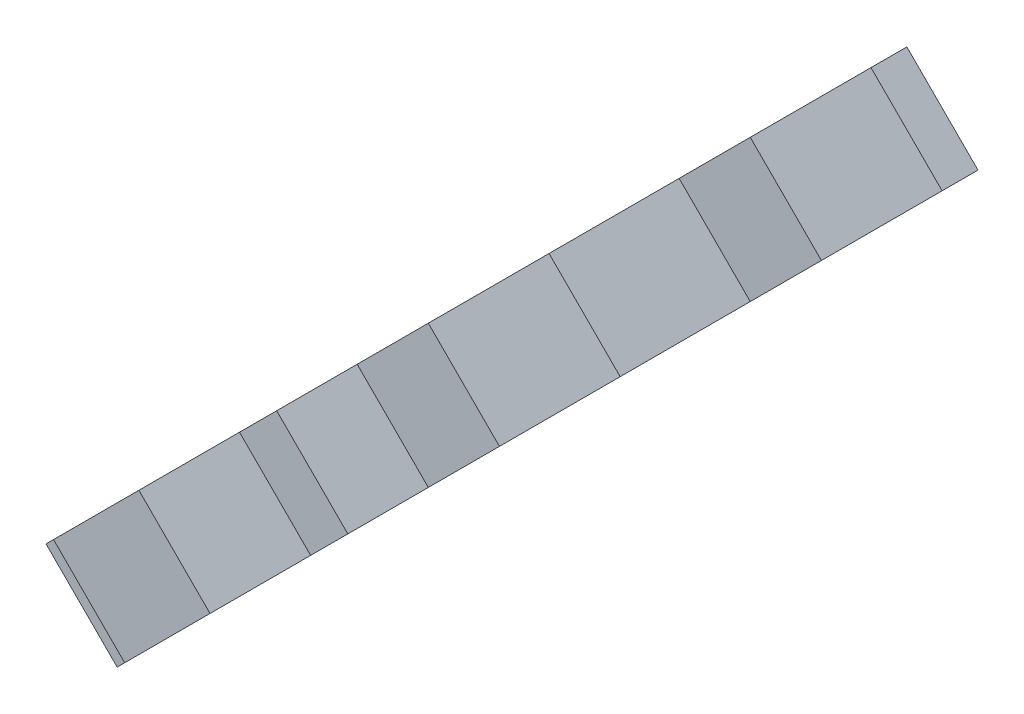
ISO-10303-21;
HEADER;
FILE_DESCRIPTION(('STEP AP214'),'2;1');
FILE_NAME('part.step','',(''),(''),'','','');
FILE_SCHEMA(('AUTOMOTIVE_DESIGN { 1 0 10303 214 1 1 1 1 }'));
ENDSEC;
DATA;
#1=APPLICATION_CONTEXT('core data for automotive mechanical design processes');
#2=APPLICATION_PROTOCOL_DEFINITION('international standard','automotive_design',2000,#1);
#3=PRODUCT_CONTEXT('',#1,'mechanical');
#4=PRODUCT('Part','Part','',(#3));
#5=PRODUCT_RELATED_PRODUCT_CATEGORY('part','',(#4));
#6=PRODUCT_DEFINITION_FORMATION('','',#4);
#7=PRODUCT_DEFINITION_CONTEXT('part definition',#1,'design');
#8=PRODUCT_DEFINITION('design','',#6,#7);
#9=PRODUCT_DEFINITION_SHAPE('','',#8);
#10=(LENGTH_UNIT() NAMED_UNIT(*) SI_UNIT(.MILLI.,.METRE.));
#11=(NAMED_UNIT(*) PLANE_ANGLE_UNIT() SI_UNIT($,.RADIAN.));
#12=(NAMED_UNIT(*) SI_UNIT($,.STERADIAN.) SOLID_ANGLE_UNIT());
#13=UNCERTAINTY_MEASURE_WITH_UNIT(LENGTH_MEASURE(1.E-05),#10,'distance_accuracy_value','');
#14=(GEOMETRIC_REPRESENTATION_CONTEXT(3) GLOBAL_UNCERTAINTY_ASSIGNED_CONTEXT((#13)) GLOBAL_UNIT_ASSIGNED_CONTEXT((#10,
#11,#12)) REPRESENTATION_CONTEXT('',''));
#15=CARTESIAN_POINT('',(0.,0.,0.));
#16=DIRECTION('',(0.,0.,1.));
#17=DIRECTION('',(1.,0.,0.));
#18=AXIS2_PLACEMENT_3D('',#15,#16,#17);
#19=CARTESIAN_POINT('',(-4.49012806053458,4.49012806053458,0.));
#20=DIRECTION('',(0.707106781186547,0.707106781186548,0.));
#21=DIRECTION('',(-0.707106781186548,0.707106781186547,0.));
#22=AXIS2_PLACEMENT_3D('',#19,#20,#21);
#23=PLANE('',#22);
#24=DIRECTION('',(0.,0.,1.));
#25=VECTOR('',#24,1.);
#26=CARTESIAN_POINT('',(-4.49012806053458,4.49012806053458,0.));
#27=LINE('',#26,#25);
#28=CARTESIAN_POINT('',(-4.49012806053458,4.49012806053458,-10.16));
#29=VERTEX_POINT('',#28);
#30=CARTESIAN_POINT('',(-4.49012806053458,4.49012806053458,0.));
#31=VERTEX_POINT('',#30);
#32=EDGE_CURVE('E318',#29,#31,#27,.T.);
#33=ORIENTED_EDGE('',*,*,#32,.F.);
#34=DIRECTION('',(-0.707106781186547,0.707106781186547,0.));
#35=VECTOR('',#34,1.);
#36=CARTESIAN_POINT('',(6.28617928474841,-6.28617928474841,-10.16));
#37=LINE('',#36,#35);
#38=CARTESIAN_POINT('',(0.,0.,-10.16));
#39=VERTEX_POINT('',#38);
#40=EDGE_CURVE('E221',#39,#29,#37,.T.);
#41=ORIENTED_EDGE('',*,*,#40,.F.);
#42=DIRECTION('',(0.,0.,1.));
#43=VECTOR('',#42,1.);
#44=CARTESIAN_POINT('',(0.,0.,0.));
#45=LINE('',#44,#43);
#46=CARTESIAN_POINT('',(0.,0.,0.));
#47=VERTEX_POINT('',#46);
#48=EDGE_CURVE('E312',#39,#47,#45,.T.);
#49=ORIENTED_EDGE('',*,*,#48,.T.);
#50=DIRECTION('',(0.707106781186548,-0.707106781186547,0.));
#51=VECTOR('',#50,1.);
#52=CARTESIAN_POINT('',(-4.49012806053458,4.49012806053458,0.));
#53=LINE('',#52,#51);
#54=EDGE_CURVE('E349',#31,#47,#53,.T.);
#55=ORIENTED_EDGE('',*,*,#54,.F.);
#56=EDGE_LOOP('',(#33,#41,#49,#55));
#57=FACE_BOUND('',#56,.T.);
#58=ADVANCED_FACE('F47',(#57),#23,.F.);
#59=CARTESIAN_POINT('',(14.5598719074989,23.5401280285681,0.));
#60=DIRECTION('',(-0.707106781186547,-0.707106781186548,0.));
#61=DIRECTION('',(0.707106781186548,-0.707106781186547,0.));
#62=AXIS2_PLACEMENT_3D('',#59,#60,#61);
#63=PLANE('',#62);
#64=DIRECTION('',(0.,0.,-1.));
#65=VECTOR('',#64,1.);
#66=CARTESIAN_POINT('',(19.0499999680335,19.0499999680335,0.));
#67=LINE('',#66,#65);
#68=CARTESIAN_POINT('',(19.0499999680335,19.0499999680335,-25.4));
#69=VERTEX_POINT('',#68);
#70=CARTESIAN_POINT('',(19.0499999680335,19.0499999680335,-33.02));
#71=VERTEX_POINT('',#70);
#72=EDGE_CURVE('E338',#69,#71,#67,.T.);
#73=ORIENTED_EDGE('',*,*,#72,.T.);
#74=DIRECTION('',(-0.707106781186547,0.707106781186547,0.));
#75=VECTOR('',#74,1.);
#76=CARTESIAN_POINT('',(25.3361792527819,12.7638206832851,-33.02));
#77=LINE('',#76,#75);
#78=CARTESIAN_POINT('',(14.5598719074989,23.5401280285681,-33.02));
#79=VERTEX_POINT('',#78);
#80=EDGE_CURVE('E189',#71,#79,#77,.T.);
#81=ORIENTED_EDGE('',*,*,#80,.T.);
#82=DIRECTION('',(0.,0.,-1.));
#83=VECTOR('',#82,1.);
#84=CARTESIAN_POINT('',(14.5598719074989,23.5401280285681,0.));
#85=LINE('',#84,#83);
#86=CARTESIAN_POINT('',(14.5598719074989,23.5401280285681,-25.4));
#87=VERTEX_POINT('',#86);
#88=EDGE_CURVE('E205',#87,#79,#85,.T.);
#89=ORIENTED_EDGE('',*,*,#88,.F.);
#90=DIRECTION('',(-0.707106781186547,0.707106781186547,0.));
#91=VECTOR('',#90,1.);
#92=CARTESIAN_POINT('',(25.3361792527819,12.7638206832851,-25.4));
#93=LINE('',#92,#91);
#94=EDGE_CURVE('E245',#69,#87,#93,.T.);
#95=ORIENTED_EDGE('',*,*,#94,.F.);
#96=EDGE_LOOP('',(#73,#81,#89,#95));
#97=FACE_BOUND('',#96,.T.);
#98=ADVANCED_FACE('F462',(#97),#63,.F.);
#99=CARTESIAN_POINT('',(-4.49012806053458,4.49012806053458,0.));
#100=DIRECTION('',(0.,0.,-1.));
#101=DIRECTION('',(-1.,0.,0.));
#102=AXIS2_PLACEMENT_3D('',#99,#100,#101);
#103=PLANE('',#102);
#104=DIRECTION('',(0.707106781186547,0.707106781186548,0.));
#105=VECTOR('',#104,1.);
#106=CARTESIAN_POINT('',(0.,0.,0.));
#107=LINE('',#106,#105);
#108=CARTESIAN_POINT('',(12.213148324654,12.213148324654,0.));
#109=VERTEX_POINT('',#108);
#110=CARTESIAN_POINT('',(14.5598719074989,14.5598719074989,0.));
#111=VERTEX_POINT('',#110);
#112=EDGE_CURVE('E334',#109,#111,#107,.T.);
#113=ORIENTED_EDGE('',*,*,#112,.T.);
#114=DIRECTION('',(-0.707106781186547,0.707106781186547,0.));
#115=VECTOR('',#114,1.);
#116=CARTESIAN_POINT('',(20.8460511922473,8.27369262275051,0.));
#117=LINE('',#116,#115);
#118=CARTESIAN_POINT('',(10.0697438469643,19.0499999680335,0.));
#119=VERTEX_POINT('',#118);
#120=EDGE_CURVE('E233',#111,#119,#117,.T.);
#121=ORIENTED_EDGE('',*,*,#120,.T.);
#122=DIRECTION('',(0.707106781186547,0.707106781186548,0.));
#123=VECTOR('',#122,1.);
#124=CARTESIAN_POINT('',(-4.49012806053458,4.49012806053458,0.));
#125=LINE('',#124,#123);
#126=CARTESIAN_POINT('',(7.72302026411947,16.7032763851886,0.));
#127=VERTEX_POINT('',#126);
#128=EDGE_CURVE('E317',#127,#119,#125,.T.);
#129=ORIENTED_EDGE('',*,*,#128,.F.);
#130=DIRECTION('',(-0.707106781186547,0.707106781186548,0.));
#131=VECTOR('',#130,1.);
#132=CARTESIAN_POINT('',(7.72302026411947,16.7032763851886,0.));
#133=LINE('',#132,#131);
#134=EDGE_CURVE('E281',#109,#127,#133,.T.);
#135=ORIENTED_EDGE('',*,*,#134,.F.);
#136=EDGE_LOOP('',(#113,#121,#129,#135));
#137=FACE_BOUND('',#136,.T.);
#138=ADVANCED_FACE('F433',(#137),#103,.F.);
#139=DIRECTION('',(0.707106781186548,-0.707106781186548,0.));
#140=VECTOR('',#139,1.);
#141=CARTESIAN_POINT('',(2.33486659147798,11.3151227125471,0.));
#142=LINE('',#141,#140);
#143=CARTESIAN_POINT('',(2.33486659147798,11.3151227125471,0.));
#144=VERTEX_POINT('',#143);
#145=CARTESIAN_POINT('',(6.82499465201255,6.82499465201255,0.));
#146=VERTEX_POINT('',#145);
#147=EDGE_CURVE('E275',#144,#146,#142,.T.);
#148=ORIENTED_EDGE('',*,*,#147,.F.);
#149=EDGE_CURVE('E319',#31,#144,#125,.T.);
#150=ORIENTED_EDGE('',*,*,#149,.F.);
#151=ORIENTED_EDGE('',*,*,#54,.T.);
#152=EDGE_CURVE('E335',#47,#146,#107,.T.);
#153=ORIENTED_EDGE('',*,*,#152,.T.);
#154=EDGE_LOOP('',(#148,#150,#151,#153));
#155=FACE_BOUND('',#154,.T.);
#156=ADVANCED_FACE('F417',(#155),#103,.F.);
#157=CARTESIAN_POINT('',(0.,0.,-26.67));
#158=VERTEX_POINT('',#157);
#159=CARTESIAN_POINT('',(0.,0.,-20.32));
#160=VERTEX_POINT('',#159);
#161=EDGE_CURVE('E330',#158,#160,#45,.T.);
#162=ORIENTED_EDGE('',*,*,#161,.T.);
#163=DIRECTION('',(-0.707106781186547,0.707106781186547,0.));
#164=VECTOR('',#163,1.);
#165=CARTESIAN_POINT('',(6.28617928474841,-6.28617928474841,-20.32));
#166=LINE('',#165,#164);
#167=CARTESIAN_POINT('',(-4.49012806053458,4.49012806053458,-20.32));
#168=VERTEX_POINT('',#167);
#169=EDGE_CURVE('E217',#160,#168,#166,.T.);
#170=ORIENTED_EDGE('',*,*,#169,.T.);
#171=CARTESIAN_POINT('',(-4.49012806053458,4.49012806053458,-26.67));
#172=VERTEX_POINT('',#171);
#173=EDGE_CURVE('E313',#172,#168,#27,.T.);
#174=ORIENTED_EDGE('',*,*,#173,.F.);
#175=DIRECTION('',(0.707106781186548,-0.707106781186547,0.));
#176=VECTOR('',#175,1.);
#177=CARTESIAN_POINT('',(-4.49012806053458,4.49012806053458,-26.67));
#178=LINE('',#177,#176);
#179=EDGE_CURVE('E329',#172,#158,#178,.T.);
#180=ORIENTED_EDGE('',*,*,#179,.T.);
#181=EDGE_LOOP('',(#162,#170,#174,#180));
#182=FACE_BOUND('',#181,.T.);
#183=ADVANCED_FACE('F49',(#182),#23,.F.);
#184=CARTESIAN_POINT('',(14.5598719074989,23.5401280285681,-5.08));
#185=VERTEX_POINT('',#184);
#186=CARTESIAN_POINT('',(14.5598719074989,23.5401280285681,-12.7));
#187=VERTEX_POINT('',#186);
#188=EDGE_CURVE('E325',#185,#187,#85,.T.);
#189=ORIENTED_EDGE('',*,*,#188,.F.);
#190=DIRECTION('',(-0.707106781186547,0.707106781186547,0.));
#191=VECTOR('',#190,1.);
#192=CARTESIAN_POINT('',(25.3361792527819,12.7638206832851,-5.08));
#193=LINE('',#192,#191);
#194=CARTESIAN_POINT('',(19.0499999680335,19.0499999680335,-5.08));
#195=VERTEX_POINT('',#194);
#196=EDGE_CURVE('E258',#195,#185,#193,.T.);
#197=ORIENTED_EDGE('',*,*,#196,.F.);
#198=CARTESIAN_POINT('',(19.0499999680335,19.0499999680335,-12.7));
#199=VERTEX_POINT('',#198);
#200=EDGE_CURVE('E342',#195,#199,#67,.T.);
#201=ORIENTED_EDGE('',*,*,#200,.T.);
#202=DIRECTION('',(-0.707106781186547,0.707106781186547,0.));
#203=VECTOR('',#202,1.);
#204=CARTESIAN_POINT('',(25.3361792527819,12.7638206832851,-12.7));
#205=LINE('',#204,#203);
#206=EDGE_CURVE('E241',#199,#187,#205,.T.);
#207=ORIENTED_EDGE('',*,*,#206,.T.);
#208=EDGE_LOOP('',(#189,#197,#201,#207));
#209=FACE_BOUND('',#208,.T.);
#210=ADVANCED_FACE('F446',(#209),#63,.F.);
#211=CARTESIAN_POINT('',(14.5598719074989,23.5401280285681,-43.815));
#212=DIRECTION('',(0.379642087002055,0.379642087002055,0.84364908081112));
#213=DIRECTION('',(0.,-0.911921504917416,0.410364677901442));
#214=AXIS2_PLACEMENT_3D('',#211,#212,#213);
#215=PLANE('',#214);
#216=DIRECTION('',(-0.59654998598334,-0.596549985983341,0.536894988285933));
#217=VECTOR('',#216,1.);
#218=CARTESIAN_POINT('',(14.5598719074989,23.5401280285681,-43.815));
#219=LINE('',#218,#217);
#220=CARTESIAN_POINT('',(10.0697438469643,19.0499999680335,-39.7738847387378));
#221=VERTEX_POINT('',#220);
#222=EDGE_CURVE('E326',#221,#172,#219,.T.);
#223=ORIENTED_EDGE('',*,*,#222,.F.);
#224=DIRECTION('',(0.707106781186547,-0.707106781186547,0.));
#225=VECTOR('',#224,1.);
#226=CARTESIAN_POINT('',(10.0697438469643,19.0499999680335,-39.7738847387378));
#227=LINE('',#226,#225);
#228=CARTESIAN_POINT('',(14.5598719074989,14.5598719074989,-39.7738847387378));
#229=VERTEX_POINT('',#228);
#230=EDGE_CURVE('E195',#221,#229,#227,.T.);
#231=ORIENTED_EDGE('',*,*,#230,.T.);
#232=DIRECTION('',(-0.59654998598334,-0.596549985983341,0.536894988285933));
#233=VECTOR('',#232,1.);
#234=CARTESIAN_POINT('',(19.0499999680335,19.0499999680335,-43.815));
#235=LINE('',#234,#233);
#236=EDGE_CURVE('E343',#229,#158,#235,.T.);
#237=ORIENTED_EDGE('',*,*,#236,.T.);
#238=ORIENTED_EDGE('',*,*,#179,.F.);
#239=EDGE_LOOP('',(#223,#231,#237,#238));
#240=FACE_BOUND('',#239,.T.);
#241=ADVANCED_FACE('F382',(#240),#215,.F.);
#242=CARTESIAN_POINT('',(-4.49012806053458,4.49012806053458,0.));
#243=DIRECTION('',(0.707106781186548,-0.707106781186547,0.));
#244=DIRECTION('',(0.707106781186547,0.707106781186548,0.));
#245=AXIS2_PLACEMENT_3D('',#242,#243,#244);
#246=PLANE('',#245);
#247=ORIENTED_EDGE('',*,*,#88,.T.);
#248=DIRECTION('',(0.707106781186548,0.707106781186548,0.));
#249=VECTOR('',#248,1.);
#250=CARTESIAN_POINT('',(14.5598719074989,23.5401280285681,-33.02));
#251=LINE('',#250,#249);
#252=CARTESIAN_POINT('',(10.0697438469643,19.0499999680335,-33.02));
#253=VERTEX_POINT('',#252);
#254=EDGE_CURVE('E184',#253,#79,#251,.T.);
#255=ORIENTED_EDGE('',*,*,#254,.F.);
#256=DIRECTION('',(0.,0.,1.));
#257=VECTOR('',#256,1.);
#258=CARTESIAN_POINT('',(10.0697438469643,19.0499999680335,-43.815));
#259=LINE('',#258,#257);
#260=EDGE_CURVE('E192',#221,#253,#259,.T.);
#261=ORIENTED_EDGE('',*,*,#260,.F.);
#262=ORIENTED_EDGE('',*,*,#222,.T.);
#263=ORIENTED_EDGE('',*,*,#173,.T.);
#264=DIRECTION('',(-0.707106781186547,-0.707106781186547,0.));
#265=VECTOR('',#264,1.);
#266=CARTESIAN_POINT('',(-4.49012806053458,4.49012806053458,-20.32));
#267=LINE('',#266,#265);
#268=CARTESIAN_POINT('',(1.84993276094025,10.8301888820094,-20.32));
#269=VERTEX_POINT('',#268);
#270=EDGE_CURVE('E214',#269,#168,#267,.T.);
#271=ORIENTED_EDGE('',*,*,#270,.F.);
#272=DIRECTION('',(0.,0.,-1.));
#273=VECTOR('',#272,1.);
#274=CARTESIAN_POINT('',(1.84993276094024,10.8301888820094,-10.16));
#275=LINE('',#274,#273);
#276=CARTESIAN_POINT('',(1.84993276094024,10.8301888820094,-10.16));
#277=VERTEX_POINT('',#276);
#278=EDGE_CURVE('E226',#277,#269,#275,.T.);
#279=ORIENTED_EDGE('',*,*,#278,.F.);
#280=DIRECTION('',(0.707106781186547,0.707106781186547,0.));
#281=VECTOR('',#280,1.);
#282=CARTESIAN_POINT('',(-4.49012806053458,4.49012806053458,-10.16));
#283=LINE('',#282,#281);
#284=EDGE_CURVE('E229',#29,#277,#283,.T.);
#285=ORIENTED_EDGE('',*,*,#284,.F.);
#286=ORIENTED_EDGE('',*,*,#32,.T.);
#287=ORIENTED_EDGE('',*,*,#149,.T.);
#288=DIRECTION('',(0.,0.,-1.));
#289=VECTOR('',#288,1.);
#290=CARTESIAN_POINT('',(2.33486659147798,11.3151227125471,6.35));
#291=LINE('',#290,#289);
#292=CARTESIAN_POINT('',(2.33486659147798,11.3151227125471,6.35));
#293=VERTEX_POINT('',#292);
#294=EDGE_CURVE('E308',#293,#144,#291,.T.);
#295=ORIENTED_EDGE('',*,*,#294,.F.);
#296=DIRECTION('',(-0.707106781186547,-0.707106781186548,0.));
#297=VECTOR('',#296,1.);
#298=CARTESIAN_POINT('',(2.33486659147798,11.3151227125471,6.35));
#299=LINE('',#298,#297);
#300=CARTESIAN_POINT('',(7.72302026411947,16.7032763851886,6.35));
#301=VERTEX_POINT('',#300);
#302=EDGE_CURVE('E276',#301,#293,#299,.T.);
#303=ORIENTED_EDGE('',*,*,#302,.F.);
#304=DIRECTION('',(0.,0.,-1.));
#305=VECTOR('',#304,1.);
#306=CARTESIAN_POINT('',(7.72302026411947,16.7032763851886,6.35));
#307=LINE('',#306,#305);
#308=EDGE_CURVE('E290',#301,#127,#307,.T.);
#309=ORIENTED_EDGE('',*,*,#308,.T.);
#310=ORIENTED_EDGE('',*,*,#128,.T.);
#311=DIRECTION('',(0.,0.,1.));
#312=VECTOR('',#311,1.);
#313=CARTESIAN_POINT('',(10.0697438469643,19.0499999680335,0.));
#314=LINE('',#313,#312);
#315=CARTESIAN_POINT('',(10.0697438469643,19.0499999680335,-5.08));
#316=VERTEX_POINT('',#315);
#317=EDGE_CURVE('E261',#316,#119,#314,.T.);
#318=ORIENTED_EDGE('',*,*,#317,.F.);
#319=DIRECTION('',(-0.707106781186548,-0.707106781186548,0.));
#320=VECTOR('',#319,1.);
#321=CARTESIAN_POINT('',(14.5598719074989,23.5401280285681,-5.08));
#322=LINE('',#321,#320);
#323=EDGE_CURVE('E248',#185,#316,#322,.T.);
#324=ORIENTED_EDGE('',*,*,#323,.F.);
#325=ORIENTED_EDGE('',*,*,#188,.T.);
#326=DIRECTION('',(0.707106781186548,0.707106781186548,0.));
#327=VECTOR('',#326,1.);
#328=CARTESIAN_POINT('',(14.5598719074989,23.5401280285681,-12.7));
#329=LINE('',#328,#327);
#330=CARTESIAN_POINT('',(10.0697438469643,19.0499999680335,-12.7));
#331=VERTEX_POINT('',#330);
#332=EDGE_CURVE('E237',#331,#187,#329,.T.);
#333=ORIENTED_EDGE('',*,*,#332,.F.);
#334=DIRECTION('',(0.,0.,1.));
#335=VECTOR('',#334,1.);
#336=CARTESIAN_POINT('',(10.0697438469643,19.0499999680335,-25.4));
#337=LINE('',#336,#335);
#338=CARTESIAN_POINT('',(10.0697438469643,19.0499999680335,-25.4));
#339=VERTEX_POINT('',#338);
#340=EDGE_CURVE('E251',#339,#331,#337,.T.);
#341=ORIENTED_EDGE('',*,*,#340,.F.);
#342=DIRECTION('',(-0.707106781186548,-0.707106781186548,0.));
#343=VECTOR('',#342,1.);
#344=CARTESIAN_POINT('',(14.5598719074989,23.5401280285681,-25.4));
#345=LINE('',#344,#343);
#346=EDGE_CURVE('E199',#87,#339,#345,.T.);
#347=ORIENTED_EDGE('',*,*,#346,.F.);
#348=EDGE_LOOP('',(#247,#255,#261,#262,#263,#271,#279,#285,#286,#287,#295,#303,#309,#310,#318,
#324,#325,#333,#341,#347));
#349=FACE_BOUND('',#348,.T.);
#350=ADVANCED_FACE('F202',(#349),#246,.F.);
#351=CARTESIAN_POINT('',(0.,0.,0.));
#352=DIRECTION('',(0.707106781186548,-0.707106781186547,0.));
#353=DIRECTION('',(0.707106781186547,0.707106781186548,0.));
#354=AXIS2_PLACEMENT_3D('',#351,#352,#353);
#355=PLANE('',#354);
#356=DIRECTION('',(-0.707106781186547,-0.707106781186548,0.));
#357=VECTOR('',#356,1.);
#358=CARTESIAN_POINT('',(0.,0.,-33.02));
#359=LINE('',#358,#357);
#360=CARTESIAN_POINT('',(14.5598719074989,14.5598719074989,-33.02));
#361=VERTEX_POINT('',#360);
#362=EDGE_CURVE('E11',#71,#361,#359,.T.);
#363=ORIENTED_EDGE('',*,*,#362,.F.);
#364=ORIENTED_EDGE('',*,*,#72,.F.);
#365=DIRECTION('',(0.707106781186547,0.707106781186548,0.));
#366=VECTOR('',#365,1.);
#367=CARTESIAN_POINT('',(0.,0.,-25.4));
#368=LINE('',#367,#366);
#369=CARTESIAN_POINT('',(14.5598719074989,14.5598719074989,-25.4));
#370=VERTEX_POINT('',#369);
#371=EDGE_CURVE('E360',#370,#69,#368,.T.);
#372=ORIENTED_EDGE('',*,*,#371,.F.);
#373=DIRECTION('',(0.,0.,-1.));
#374=VECTOR('',#373,1.);
#375=CARTESIAN_POINT('',(14.5598719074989,14.5598719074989,0.));
#376=LINE('',#375,#374);
#377=CARTESIAN_POINT('',(14.5598719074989,14.5598719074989,-12.7));
#378=VERTEX_POINT('',#377);
#379=EDGE_CURVE('E353',#378,#370,#376,.T.);
#380=ORIENTED_EDGE('',*,*,#379,.F.);
#381=DIRECTION('',(-0.707106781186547,-0.707106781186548,0.));
#382=VECTOR('',#381,1.);
#383=CARTESIAN_POINT('',(0.,0.,-12.7));
#384=LINE('',#383,#382);
#385=EDGE_CURVE('E356',#199,#378,#384,.T.);
#386=ORIENTED_EDGE('',*,*,#385,.F.);
#387=ORIENTED_EDGE('',*,*,#200,.F.);
#388=DIRECTION('',(0.707106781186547,0.707106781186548,0.));
#389=VECTOR('',#388,1.);
#390=CARTESIAN_POINT('',(0.,0.,-5.08));
#391=LINE('',#390,#389);
#392=CARTESIAN_POINT('',(14.5598719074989,14.5598719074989,-5.08));
#393=VERTEX_POINT('',#392);
#394=EDGE_CURVE('E363',#393,#195,#391,.T.);
#395=ORIENTED_EDGE('',*,*,#394,.F.);
#396=DIRECTION('',(0.,0.,-1.));
#397=VECTOR('',#396,1.);
#398=CARTESIAN_POINT('',(14.5598719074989,14.5598719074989,0.));
#399=LINE('',#398,#397);
#400=EDGE_CURVE('E366',#111,#393,#399,.T.);
#401=ORIENTED_EDGE('',*,*,#400,.F.);
#402=ORIENTED_EDGE('',*,*,#112,.F.);
#403=DIRECTION('',(0.,0.,-1.));
#404=VECTOR('',#403,1.);
#405=CARTESIAN_POINT('',(12.213148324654,12.213148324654,6.35));
#406=LINE('',#405,#404);
#407=CARTESIAN_POINT('',(12.213148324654,12.213148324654,6.35));
#408=VERTEX_POINT('',#407);
#409=EDGE_CURVE('E300',#408,#109,#406,.T.);
#410=ORIENTED_EDGE('',*,*,#409,.F.);
#411=DIRECTION('',(0.707106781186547,0.707106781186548,0.));
#412=VECTOR('',#411,1.);
#413=CARTESIAN_POINT('',(6.82499465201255,6.82499465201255,6.35));
#414=LINE('',#413,#412);
#415=CARTESIAN_POINT('',(6.82499465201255,6.82499465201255,6.35));
#416=VERTEX_POINT('',#415);
#417=EDGE_CURVE('E284',#416,#408,#414,.T.);
#418=ORIENTED_EDGE('',*,*,#417,.F.);
#419=DIRECTION('',(0.,0.,-1.));
#420=VECTOR('',#419,1.);
#421=CARTESIAN_POINT('',(6.82499465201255,6.82499465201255,6.35));
#422=LINE('',#421,#420);
#423=EDGE_CURVE('E304',#416,#146,#422,.T.);
#424=ORIENTED_EDGE('',*,*,#423,.T.);
#425=ORIENTED_EDGE('',*,*,#152,.F.);
#426=ORIENTED_EDGE('',*,*,#48,.F.);
#427=DIRECTION('',(-0.707106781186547,-0.707106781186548,0.));
#428=VECTOR('',#427,1.);
#429=CARTESIAN_POINT('',(0.,0.,-10.16));
#430=LINE('',#429,#428);
#431=CARTESIAN_POINT('',(6.34006082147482,6.34006082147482,-10.16));
#432=VERTEX_POINT('',#431);
#433=EDGE_CURVE('E376',#432,#39,#430,.T.);
#434=ORIENTED_EDGE('',*,*,#433,.F.);
#435=DIRECTION('',(0.,0.,1.));
#436=VECTOR('',#435,1.);
#437=CARTESIAN_POINT('',(6.34006082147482,6.34006082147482,0.));
#438=LINE('',#437,#436);
#439=CARTESIAN_POINT('',(6.34006082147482,6.34006082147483,-20.32));
#440=VERTEX_POINT('',#439);
#441=EDGE_CURVE('E370',#440,#432,#438,.T.);
#442=ORIENTED_EDGE('',*,*,#441,.F.);
#443=DIRECTION('',(0.707106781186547,0.707106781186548,0.));
#444=VECTOR('',#443,1.);
#445=CARTESIAN_POINT('',(0.,0.,-20.32));
#446=LINE('',#445,#444);
#447=EDGE_CURVE('E373',#160,#440,#446,.T.);
#448=ORIENTED_EDGE('',*,*,#447,.F.);
#449=ORIENTED_EDGE('',*,*,#161,.F.);
#450=ORIENTED_EDGE('',*,*,#236,.F.);
#451=DIRECTION('',(0.,0.,-1.));
#452=VECTOR('',#451,1.);
#453=CARTESIAN_POINT('',(14.5598719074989,14.5598719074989,0.));
#454=LINE('',#453,#452);
#455=EDGE_CURVE('E56',#361,#229,#454,.T.);
#456=ORIENTED_EDGE('',*,*,#455,.F.);
#457=EDGE_LOOP('',(#363,#364,#372,#380,#386,#387,#395,#401,#402,#410,#418,#424,#425,#426,#434,
#442,#448,#449,#450,#456));
#458=FACE_BOUND('',#457,.T.);
#459=ADVANCED_FACE('F385',(#458),#355,.T.);
#460=CARTESIAN_POINT('',(2.33486659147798,11.3151227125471,6.35));
#461=DIRECTION('',(0.707106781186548,0.707106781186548,0.));
#462=DIRECTION('',(-0.707106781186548,0.707106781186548,0.));
#463=AXIS2_PLACEMENT_3D('',#460,#461,#462);
#464=PLANE('',#463);
#465=ORIENTED_EDGE('',*,*,#147,.T.);
#466=ORIENTED_EDGE('',*,*,#423,.F.);
#467=DIRECTION('',(0.707106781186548,-0.707106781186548,0.));
#468=VECTOR('',#467,1.);
#469=CARTESIAN_POINT('',(2.33486659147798,11.3151227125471,6.35));
#470=LINE('',#469,#468);
#471=EDGE_CURVE('E280',#293,#416,#470,.T.);
#472=ORIENTED_EDGE('',*,*,#471,.F.);
#473=ORIENTED_EDGE('',*,*,#294,.T.);
#474=EDGE_LOOP('',(#465,#466,#472,#473));
#475=FACE_BOUND('',#474,.T.);
#476=ADVANCED_FACE('F421',(#475),#464,.F.);
#477=CARTESIAN_POINT('',(7.72302026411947,16.7032763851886,6.35));
#478=DIRECTION('',(-0.707106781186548,-0.707106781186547,0.));
#479=DIRECTION('',(0.707106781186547,-0.707106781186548,0.));
#480=AXIS2_PLACEMENT_3D('',#477,#478,#479);
#481=PLANE('',#480);
#482=ORIENTED_EDGE('',*,*,#134,.T.);
#483=ORIENTED_EDGE('',*,*,#308,.F.);
#484=DIRECTION('',(-0.707106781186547,0.707106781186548,0.));
#485=VECTOR('',#484,1.);
#486=CARTESIAN_POINT('',(7.72302026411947,16.7032763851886,6.35));
#487=LINE('',#486,#485);
#488=EDGE_CURVE('E287',#408,#301,#487,.T.);
#489=ORIENTED_EDGE('',*,*,#488,.F.);
#490=ORIENTED_EDGE('',*,*,#409,.T.);
#491=EDGE_LOOP('',(#482,#483,#489,#490));
#492=FACE_BOUND('',#491,.T.);
#493=ADVANCED_FACE('F429',(#492),#481,.F.);
#494=CARTESIAN_POINT('',(0.,0.,6.35));
#495=DIRECTION('',(0.,0.,-1.));
#496=DIRECTION('',(-1.,0.,0.));
#497=AXIS2_PLACEMENT_3D('',#494,#495,#496);
#498=PLANE('',#497);
#499=ORIENTED_EDGE('',*,*,#302,.T.);
#500=ORIENTED_EDGE('',*,*,#471,.T.);
#501=ORIENTED_EDGE('',*,*,#417,.T.);
#502=ORIENTED_EDGE('',*,*,#488,.T.);
#503=EDGE_LOOP('',(#499,#500,#501,#502));
#504=FACE_BOUND('',#503,.T.);
#505=ADVANCED_FACE('F423',(#504),#498,.F.);
#506=CARTESIAN_POINT('',(25.3361792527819,12.7638206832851,-25.4));
#507=DIRECTION('',(0.,0.,-1.));
#508=DIRECTION('',(-1.,0.,0.));
#509=AXIS2_PLACEMENT_3D('',#506,#507,#508);
#510=PLANE('',#509);
#511=ORIENTED_EDGE('',*,*,#371,.T.);
#512=ORIENTED_EDGE('',*,*,#94,.T.);
#513=ORIENTED_EDGE('',*,*,#346,.T.);
#514=DIRECTION('',(-0.707106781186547,0.707106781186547,0.));
#515=VECTOR('',#514,1.);
#516=CARTESIAN_POINT('',(20.8460511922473,8.27369262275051,-25.4));
#517=LINE('',#516,#515);
#518=EDGE_CURVE('E234',#370,#339,#517,.T.);
#519=ORIENTED_EDGE('',*,*,#518,.F.);
#520=EDGE_LOOP('',(#511,#512,#513,#519));
#521=FACE_BOUND('',#520,.T.);
#522=ADVANCED_FACE('F458',(#521),#510,.F.);
#523=CARTESIAN_POINT('',(25.3361792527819,12.7638206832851,-12.7));
#524=DIRECTION('',(0.,0.,1.));
#525=DIRECTION('',(1.,0.,0.));
#526=AXIS2_PLACEMENT_3D('',#523,#524,#525);
#527=PLANE('',#526);
#528=ORIENTED_EDGE('',*,*,#385,.T.);
#529=DIRECTION('',(-0.707106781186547,0.707106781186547,0.));
#530=VECTOR('',#529,1.);
#531=CARTESIAN_POINT('',(20.8460511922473,8.27369262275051,-12.7));
#532=LINE('',#531,#530);
#533=EDGE_CURVE('E238',#378,#331,#532,.T.);
#534=ORIENTED_EDGE('',*,*,#533,.T.);
#535=ORIENTED_EDGE('',*,*,#332,.T.);
#536=ORIENTED_EDGE('',*,*,#206,.F.);
#537=EDGE_LOOP('',(#528,#534,#535,#536));
#538=FACE_BOUND('',#537,.T.);
#539=ADVANCED_FACE('F450',(#538),#527,.F.);
#540=CARTESIAN_POINT('',(20.8460511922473,8.27369262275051,-25.4));
#541=DIRECTION('',(-0.707106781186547,-0.707106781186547,0.));
#542=DIRECTION('',(0.707106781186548,-0.707106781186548,0.));
#543=AXIS2_PLACEMENT_3D('',#540,#541,#542);
#544=PLANE('',#543);
#545=ORIENTED_EDGE('',*,*,#379,.T.);
#546=ORIENTED_EDGE('',*,*,#518,.T.);
#547=ORIENTED_EDGE('',*,*,#340,.T.);
#548=ORIENTED_EDGE('',*,*,#533,.F.);
#549=EDGE_LOOP('',(#545,#546,#547,#548));
#550=FACE_BOUND('',#549,.T.);
#551=ADVANCED_FACE('F456',(#550),#544,.F.);
#552=CARTESIAN_POINT('',(20.8460511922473,8.27369262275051,0.));
#553=DIRECTION('',(-0.707106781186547,-0.707106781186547,0.));
#554=DIRECTION('',(0.707106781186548,-0.707106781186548,0.));
#555=AXIS2_PLACEMENT_3D('',#552,#553,#554);
#556=PLANE('',#555);
#557=ORIENTED_EDGE('',*,*,#400,.T.);
#558=DIRECTION('',(-0.707106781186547,0.707106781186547,0.));
#559=VECTOR('',#558,1.);
#560=CARTESIAN_POINT('',(20.8460511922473,8.27369262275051,-5.08));
#561=LINE('',#560,#559);
#562=EDGE_CURVE('E262',#393,#316,#561,.T.);
#563=ORIENTED_EDGE('',*,*,#562,.T.);
#564=ORIENTED_EDGE('',*,*,#317,.T.);
#565=ORIENTED_EDGE('',*,*,#120,.F.);
#566=EDGE_LOOP('',(#557,#563,#564,#565));
#567=FACE_BOUND('',#566,.T.);
#568=ADVANCED_FACE('F438',(#567),#556,.F.);
#569=CARTESIAN_POINT('',(25.3361792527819,12.7638206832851,-5.08));
#570=DIRECTION('',(0.,0.,-1.));
#571=DIRECTION('',(-1.,0.,0.));
#572=AXIS2_PLACEMENT_3D('',#569,#570,#571);
#573=PLANE('',#572);
#574=ORIENTED_EDGE('',*,*,#394,.T.);
#575=ORIENTED_EDGE('',*,*,#196,.T.);
#576=ORIENTED_EDGE('',*,*,#323,.T.);
#577=ORIENTED_EDGE('',*,*,#562,.F.);
#578=EDGE_LOOP('',(#574,#575,#576,#577));
#579=FACE_BOUND('',#578,.T.);
#580=ADVANCED_FACE('F540',(#579),#573,.F.);
#581=CARTESIAN_POINT('',(6.28617928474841,-6.28617928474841,-10.16));
#582=DIRECTION('',(0.,0.,1.));
#583=DIRECTION('',(1.,0.,0.));
#584=AXIS2_PLACEMENT_3D('',#581,#582,#583);
#585=PLANE('',#584);
#586=ORIENTED_EDGE('',*,*,#433,.T.);
#587=ORIENTED_EDGE('',*,*,#40,.T.);
#588=ORIENTED_EDGE('',*,*,#284,.T.);
#589=DIRECTION('',(-0.707106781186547,0.707106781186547,0.));
#590=VECTOR('',#589,1.);
#591=CARTESIAN_POINT('',(12.6262401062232,0.0538815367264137,-10.16));
#592=LINE('',#591,#590);
#593=EDGE_CURVE('E211',#432,#277,#592,.T.);
#594=ORIENTED_EDGE('',*,*,#593,.F.);
#595=EDGE_LOOP('',(#586,#587,#588,#594));
#596=FACE_BOUND('',#595,.T.);
#597=ADVANCED_FACE('F399',(#596),#585,.F.);
#598=CARTESIAN_POINT('',(6.28617928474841,-6.28617928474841,-20.32));
#599=DIRECTION('',(0.,0.,-1.));
#600=DIRECTION('',(-1.,0.,0.));
#601=AXIS2_PLACEMENT_3D('',#598,#599,#600);
#602=PLANE('',#601);
#603=ORIENTED_EDGE('',*,*,#447,.T.);
#604=DIRECTION('',(-0.707106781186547,0.707106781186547,0.));
#605=VECTOR('',#604,1.);
#606=CARTESIAN_POINT('',(12.6262401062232,0.0538815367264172,-20.32));
#607=LINE('',#606,#605);
#608=EDGE_CURVE('E70',#440,#269,#607,.T.);
#609=ORIENTED_EDGE('',*,*,#608,.T.);
#610=ORIENTED_EDGE('',*,*,#270,.T.);
#611=ORIENTED_EDGE('',*,*,#169,.F.);
#612=EDGE_LOOP('',(#603,#609,#610,#611));
#613=FACE_BOUND('',#612,.T.);
#614=ADVANCED_FACE('F394',(#613),#602,.F.);
#615=CARTESIAN_POINT('',(12.6262401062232,0.0538815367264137,-10.16));
#616=DIRECTION('',(0.707106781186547,0.707106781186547,0.));
#617=DIRECTION('',(-0.707106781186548,0.707106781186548,0.));
#618=AXIS2_PLACEMENT_3D('',#615,#616,#617);
#619=PLANE('',#618);
#620=ORIENTED_EDGE('',*,*,#441,.T.);
#621=ORIENTED_EDGE('',*,*,#593,.T.);
#622=ORIENTED_EDGE('',*,*,#278,.T.);
#623=ORIENTED_EDGE('',*,*,#608,.F.);
#624=EDGE_LOOP('',(#620,#621,#622,#623));
#625=FACE_BOUND('',#624,.T.);
#626=ADVANCED_FACE('F395',(#625),#619,.F.);
#627=CARTESIAN_POINT('',(20.8460511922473,8.27369262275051,-43.815));
#628=DIRECTION('',(-0.707106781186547,-0.707106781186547,0.));
#629=DIRECTION('',(0.707106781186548,-0.707106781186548,0.));
#630=AXIS2_PLACEMENT_3D('',#627,#628,#629);
#631=PLANE('',#630);
#632=ORIENTED_EDGE('',*,*,#260,.T.);
#633=DIRECTION('',(-0.707106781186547,0.707106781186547,0.));
#634=VECTOR('',#633,1.);
#635=CARTESIAN_POINT('',(20.8460511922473,8.27369262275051,-33.02));
#636=LINE('',#635,#634);
#637=EDGE_CURVE('E63',#361,#253,#636,.T.);
#638=ORIENTED_EDGE('',*,*,#637,.F.);
#639=ORIENTED_EDGE('',*,*,#455,.T.);
#640=ORIENTED_EDGE('',*,*,#230,.F.);
#641=EDGE_LOOP('',(#632,#638,#639,#640));
#642=FACE_BOUND('',#641,.T.);
#643=ADVANCED_FACE('F193',(#642),#631,.F.);
#644=CARTESIAN_POINT('',(25.3361792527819,12.7638206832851,-33.02));
#645=DIRECTION('',(0.,0.,1.));
#646=DIRECTION('',(1.,0.,0.));
#647=AXIS2_PLACEMENT_3D('',#644,#645,#646);
#648=PLANE('',#647);
#649=ORIENTED_EDGE('',*,*,#362,.T.);
#650=ORIENTED_EDGE('',*,*,#637,.T.);
#651=ORIENTED_EDGE('',*,*,#254,.T.);
#652=ORIENTED_EDGE('',*,*,#80,.F.);
#653=EDGE_LOOP('',(#649,#650,#651,#652));
#654=FACE_BOUND('',#653,.T.);
#655=ADVANCED_FACE('F182',(#654),#648,.F.);
#656=CLOSED_SHELL('',(#58,#98,#138,#156,#183,#210,#241,#350,#459,#476,#493,#505,#522,#539,#551,
#568,#580,#597,#614,#626,#643,#655));
#657=MANIFOLD_SOLID_BREP('B2',#656);
#658=ADVANCED_BREP_SHAPE_REPRESENTATION('',(#18,#657),#14);
#659=SHAPE_DEFINITION_REPRESENTATION(#9,#658);
ENDSEC;
END-ISO-10303-21;
